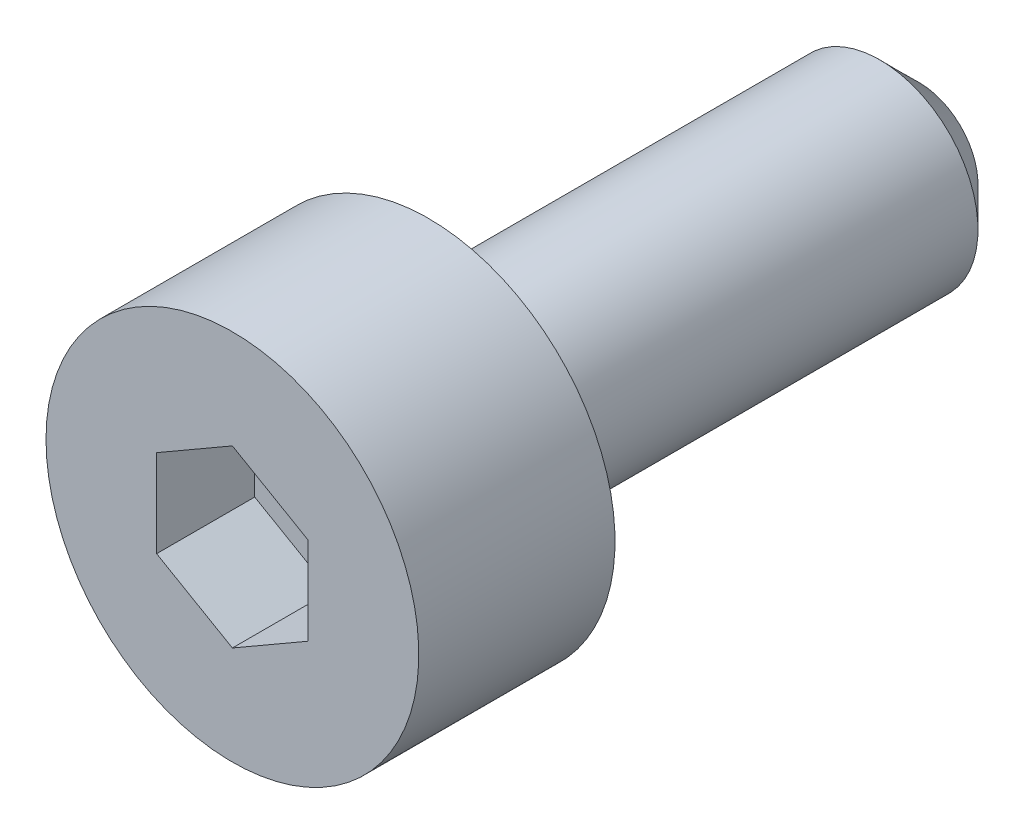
ISO-10303-21;
HEADER;
FILE_DESCRIPTION(('STEP AP214'),'2;1');
FILE_NAME('part.step','',(''),(''),'','','');
FILE_SCHEMA(('AUTOMOTIVE_DESIGN { 1 0 10303 214 1 1 1 1 }'));
ENDSEC;
DATA;
#1=APPLICATION_CONTEXT('core data for automotive mechanical design processes');
#2=APPLICATION_PROTOCOL_DEFINITION('international standard','automotive_design',2000,#1);
#3=PRODUCT_CONTEXT('',#1,'mechanical');
#4=PRODUCT('Part','Part','',(#3));
#5=PRODUCT_RELATED_PRODUCT_CATEGORY('part','',(#4));
#6=PRODUCT_DEFINITION_FORMATION('','',#4);
#7=PRODUCT_DEFINITION_CONTEXT('part definition',#1,'design');
#8=PRODUCT_DEFINITION('design','',#6,#7);
#9=PRODUCT_DEFINITION_SHAPE('','',#8);
#10=(LENGTH_UNIT() NAMED_UNIT(*) SI_UNIT(.MILLI.,.METRE.));
#11=(NAMED_UNIT(*) PLANE_ANGLE_UNIT() SI_UNIT($,.RADIAN.));
#12=(NAMED_UNIT(*) SI_UNIT($,.STERADIAN.) SOLID_ANGLE_UNIT());
#13=UNCERTAINTY_MEASURE_WITH_UNIT(LENGTH_MEASURE(1.E-05),#10,'distance_accuracy_value','');
#14=(GEOMETRIC_REPRESENTATION_CONTEXT(3) GLOBAL_UNCERTAINTY_ASSIGNED_CONTEXT((#13)) GLOBAL_UNIT_ASSIGNED_CONTEXT((#10,
#11,#12)) REPRESENTATION_CONTEXT('',''));
#15=CARTESIAN_POINT('',(0.,0.,0.));
#16=DIRECTION('',(0.,0.,1.));
#17=DIRECTION('',(1.,0.,0.));
#18=AXIS2_PLACEMENT_3D('',#15,#16,#17);
#19=CARTESIAN_POINT('',(0.,0.,0.));
#20=DIRECTION('',(0.,0.,-1.));
#21=DIRECTION('',(-1.,0.,0.));
#22=AXIS2_PLACEMENT_3D('',#19,#20,#21);
#23=PLANE('',#22);
#24=CARTESIAN_POINT('',(0.,0.,0.));
#25=DIRECTION('',(0.,0.,-1.));
#26=DIRECTION('',(-1.,0.,0.));
#27=AXIS2_PLACEMENT_3D('',#24,#25,#26);
#28=CIRCLE('',#27,1.9);
#29=CARTESIAN_POINT('',(-1.9,0.,0.));
#30=VERTEX_POINT('',#29);
#31=EDGE_CURVE('E124',#30,#30,#28,.T.);
#32=ORIENTED_EDGE('',*,*,#31,.T.);
#33=EDGE_LOOP('',(#32));
#34=FACE_BOUND('',#33,.T.);
#35=CARTESIAN_POINT('',(0.,0.,0.));
#36=DIRECTION('',(0.,0.,-1.));
#37=DIRECTION('',(-1.,0.,0.));
#38=AXIS2_PLACEMENT_3D('',#35,#36,#37);
#39=CIRCLE('',#38,1.);
#40=CARTESIAN_POINT('',(-1.,0.,0.));
#41=VERTEX_POINT('',#40);
#42=EDGE_CURVE('E116',#41,#41,#39,.T.);
#43=ORIENTED_EDGE('',*,*,#42,.F.);
#44=EDGE_LOOP('',(#43));
#45=FACE_BOUND('',#44,.T.);
#46=ADVANCED_FACE('F14',(#34,#45),#23,.T.);
#47=CARTESIAN_POINT('',(0.,0.,2.));
#48=DIRECTION('',(0.,0.,-1.));
#49=DIRECTION('',(-1.,0.,0.));
#50=AXIS2_PLACEMENT_3D('',#47,#48,#49);
#51=CYLINDRICAL_SURFACE('',#50,1.9);
#52=CARTESIAN_POINT('',(0.,0.,2.));
#53=DIRECTION('',(0.,0.,-1.));
#54=DIRECTION('',(-1.,0.,0.));
#55=AXIS2_PLACEMENT_3D('',#52,#53,#54);
#56=CIRCLE('',#55,1.9);
#57=CARTESIAN_POINT('',(-1.9,0.,2.));
#58=VERTEX_POINT('',#57);
#59=EDGE_CURVE('E125',#58,#58,#56,.T.);
#60=ORIENTED_EDGE('',*,*,#59,.T.);
#61=EDGE_LOOP('',(#60));
#62=FACE_BOUND('',#61,.T.);
#63=ORIENTED_EDGE('',*,*,#31,.F.);
#64=EDGE_LOOP('',(#63));
#65=FACE_BOUND('',#64,.T.);
#66=ADVANCED_FACE('F149',(#62,#65),#51,.T.);
#67=CARTESIAN_POINT('',(0.,0.,2.));
#68=DIRECTION('',(0.,0.,-1.));
#69=DIRECTION('',(-1.,0.,0.));
#70=AXIS2_PLACEMENT_3D('',#67,#68,#69);
#71=PLANE('',#70);
#72=DIRECTION('',(-0.866025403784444,-0.5,0.));
#73=VECTOR('',#72,1.);
#74=CARTESIAN_POINT('',(0.,0.892006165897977,2.));
#75=LINE('',#74,#73);
#76=CARTESIAN_POINT('',(0.,0.892006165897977,2.));
#77=VERTEX_POINT('',#76);
#78=CARTESIAN_POINT('',(-0.7725,0.446003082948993,2.));
#79=VERTEX_POINT('',#78);
#80=EDGE_CURVE('E103',#77,#79,#75,.T.);
#81=ORIENTED_EDGE('',*,*,#80,.F.);
#82=DIRECTION('',(-0.866025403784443,0.5,0.));
#83=VECTOR('',#82,1.);
#84=CARTESIAN_POINT('',(0.7725,0.446003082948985,2.));
#85=LINE('',#84,#83);
#86=CARTESIAN_POINT('',(0.7725,0.446003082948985,2.));
#87=VERTEX_POINT('',#86);
#88=EDGE_CURVE('E29',#87,#77,#85,.T.);
#89=ORIENTED_EDGE('',*,*,#88,.F.);
#90=DIRECTION('',(0.,1.,0.));
#91=VECTOR('',#90,1.);
#92=CARTESIAN_POINT('',(0.7725,-0.446003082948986,2.));
#93=LINE('',#92,#91);
#94=CARTESIAN_POINT('',(0.7725,-0.446003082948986,2.));
#95=VERTEX_POINT('',#94);
#96=EDGE_CURVE('E112',#95,#87,#93,.T.);
#97=ORIENTED_EDGE('',*,*,#96,.F.);
#98=DIRECTION('',(0.866025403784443,0.5,0.));
#99=VECTOR('',#98,1.);
#100=CARTESIAN_POINT('',(0.,-0.892006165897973,2.));
#101=LINE('',#100,#99);
#102=CARTESIAN_POINT('',(0.,-0.892006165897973,2.));
#103=VERTEX_POINT('',#102);
#104=EDGE_CURVE('E110',#103,#95,#101,.T.);
#105=ORIENTED_EDGE('',*,*,#104,.F.);
#106=DIRECTION('',(0.866025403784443,-0.5,0.));
#107=VECTOR('',#106,1.);
#108=CARTESIAN_POINT('',(-0.7725,-0.446003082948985,2.));
#109=LINE('',#108,#107);
#110=CARTESIAN_POINT('',(-0.7725,-0.446003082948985,2.));
#111=VERTEX_POINT('',#110);
#112=EDGE_CURVE('E77',#111,#103,#109,.T.);
#113=ORIENTED_EDGE('',*,*,#112,.F.);
#114=DIRECTION('',(0.,-1.,0.));
#115=VECTOR('',#114,1.);
#116=CARTESIAN_POINT('',(-0.7725,0.446003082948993,2.));
#117=LINE('',#116,#115);
#118=EDGE_CURVE('E106',#79,#111,#117,.T.);
#119=ORIENTED_EDGE('',*,*,#118,.F.);
#120=EDGE_LOOP('',(#81,#89,#97,#105,#113,#119));
#121=FACE_BOUND('',#120,.T.);
#122=ORIENTED_EDGE('',*,*,#59,.F.);
#123=EDGE_LOOP('',(#122));
#124=FACE_BOUND('',#123,.T.);
#125=ADVANCED_FACE('F156',(#121,#124),#71,.F.);
#126=CARTESIAN_POINT('',(0.,0.,-5.));
#127=DIRECTION('',(0.,0.,1.));
#128=DIRECTION('',(1.,0.,0.));
#129=AXIS2_PLACEMENT_3D('',#126,#127,#128);
#130=CYLINDRICAL_SURFACE('',#129,1.);
#131=CARTESIAN_POINT('',(0.,0.,-4.6));
#132=DIRECTION('',(0.,0.,-1.));
#133=DIRECTION('',(-1.,0.,0.));
#134=AXIS2_PLACEMENT_3D('',#131,#132,#133);
#135=CIRCLE('',#134,1.);
#136=CARTESIAN_POINT('',(-1.,0.,-4.6));
#137=VERTEX_POINT('',#136);
#138=EDGE_CURVE('E9',#137,#137,#135,.F.);
#139=ORIENTED_EDGE('',*,*,#138,.T.);
#140=EDGE_LOOP('',(#139));
#141=FACE_BOUND('',#140,.T.);
#142=ORIENTED_EDGE('',*,*,#42,.T.);
#143=EDGE_LOOP('',(#142));
#144=FACE_BOUND('',#143,.T.);
#145=ADVANCED_FACE('F145',(#141,#144),#130,.T.);
#146=CARTESIAN_POINT('',(0.,0.,-5.));
#147=DIRECTION('',(0.,0.,-1.));
#148=DIRECTION('',(-1.,0.,0.));
#149=AXIS2_PLACEMENT_3D('',#146,#147,#148);
#150=PLANE('',#149);
#151=CARTESIAN_POINT('',(0.,0.,-5.));
#152=DIRECTION('',(0.,0.,-1.));
#153=DIRECTION('',(-1.,0.,0.));
#154=AXIS2_PLACEMENT_3D('',#151,#152,#153);
#155=CIRCLE('',#154,0.6);
#156=CARTESIAN_POINT('',(-0.6,0.,-5.));
#157=VERTEX_POINT('',#156);
#158=EDGE_CURVE('E22',#157,#157,#155,.T.);
#159=ORIENTED_EDGE('',*,*,#158,.T.);
#160=EDGE_LOOP('',(#159));
#161=FACE_BOUND('',#160,.T.);
#162=ADVANCED_FACE('F132',(#161),#150,.T.);
#163=CARTESIAN_POINT('',(0.,0.,-5.));
#164=DIRECTION('',(0.,0.,1.));
#165=DIRECTION('',(1.,0.,0.));
#166=AXIS2_PLACEMENT_3D('',#163,#164,#165);
#167=CONICAL_SURFACE('',#166,0.6,0.785398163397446);
#168=ORIENTED_EDGE('',*,*,#138,.F.);
#169=EDGE_LOOP('',(#168));
#170=FACE_BOUND('',#169,.T.);
#171=ORIENTED_EDGE('',*,*,#158,.F.);
#172=EDGE_LOOP('',(#171));
#173=FACE_BOUND('',#172,.T.);
#174=ADVANCED_FACE('F16',(#170,#173),#167,.T.);
#175=CARTESIAN_POINT('',(0.7725,0.446003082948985,1.));
#176=DIRECTION('',(0.5,0.866025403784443,0.));
#177=DIRECTION('',(0.866025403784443,-0.5,0.));
#178=AXIS2_PLACEMENT_3D('',#175,#176,#177);
#179=PLANE('',#178);
#180=ORIENTED_EDGE('',*,*,#88,.T.);
#181=DIRECTION('',(0.,0.,1.));
#182=VECTOR('',#181,1.);
#183=CARTESIAN_POINT('',(0.,0.892006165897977,1.));
#184=LINE('',#183,#182);
#185=CARTESIAN_POINT('',(0.,0.892006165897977,1.));
#186=VERTEX_POINT('',#185);
#187=EDGE_CURVE('E59',#186,#77,#184,.T.);
#188=ORIENTED_EDGE('',*,*,#187,.F.);
#189=DIRECTION('',(-0.866025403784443,0.5,0.));
#190=VECTOR('',#189,1.);
#191=CARTESIAN_POINT('',(0.7725,0.446003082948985,1.));
#192=LINE('',#191,#190);
#193=CARTESIAN_POINT('',(0.7725,0.446003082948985,1.));
#194=VERTEX_POINT('',#193);
#195=EDGE_CURVE('E114',#194,#186,#192,.T.);
#196=ORIENTED_EDGE('',*,*,#195,.F.);
#197=DIRECTION('',(0.,0.,1.));
#198=VECTOR('',#197,1.);
#199=CARTESIAN_POINT('',(0.7725,0.446003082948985,1.));
#200=LINE('',#199,#198);
#201=EDGE_CURVE('E37',#194,#87,#200,.T.);
#202=ORIENTED_EDGE('',*,*,#201,.T.);
#203=EDGE_LOOP('',(#180,#188,#196,#202));
#204=FACE_BOUND('',#203,.T.);
#205=ADVANCED_FACE('F135',(#204),#179,.F.);
#206=CARTESIAN_POINT('',(0.7725,-0.446003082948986,1.));
#207=DIRECTION('',(1.,0.,0.));
#208=DIRECTION('',(0.,-1.,0.));
#209=AXIS2_PLACEMENT_3D('',#206,#207,#208);
#210=PLANE('',#209);
#211=ORIENTED_EDGE('',*,*,#96,.T.);
#212=ORIENTED_EDGE('',*,*,#201,.F.);
#213=DIRECTION('',(0.,1.,0.));
#214=VECTOR('',#213,1.);
#215=CARTESIAN_POINT('',(0.7725,-0.446003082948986,1.));
#216=LINE('',#215,#214);
#217=CARTESIAN_POINT('',(0.7725,-0.446003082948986,1.));
#218=VERTEX_POINT('',#217);
#219=EDGE_CURVE('E89',#218,#194,#216,.T.);
#220=ORIENTED_EDGE('',*,*,#219,.F.);
#221=DIRECTION('',(0.,0.,1.));
#222=VECTOR('',#221,1.);
#223=CARTESIAN_POINT('',(0.7725,-0.446003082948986,1.));
#224=LINE('',#223,#222);
#225=EDGE_CURVE('E81',#218,#95,#224,.T.);
#226=ORIENTED_EDGE('',*,*,#225,.T.);
#227=EDGE_LOOP('',(#211,#212,#220,#226));
#228=FACE_BOUND('',#227,.T.);
#229=ADVANCED_FACE('F143',(#228),#210,.F.);
#230=CARTESIAN_POINT('',(0.,-0.892006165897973,1.));
#231=DIRECTION('',(0.5,-0.866025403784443,0.));
#232=DIRECTION('',(-0.866025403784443,-0.5,0.));
#233=AXIS2_PLACEMENT_3D('',#230,#231,#232);
#234=PLANE('',#233);
#235=ORIENTED_EDGE('',*,*,#104,.T.);
#236=ORIENTED_EDGE('',*,*,#225,.F.);
#237=DIRECTION('',(0.866025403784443,0.5,0.));
#238=VECTOR('',#237,1.);
#239=CARTESIAN_POINT('',(0.,-0.892006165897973,1.));
#240=LINE('',#239,#238);
#241=CARTESIAN_POINT('',(0.,-0.892006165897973,1.));
#242=VERTEX_POINT('',#241);
#243=EDGE_CURVE('E85',#242,#218,#240,.T.);
#244=ORIENTED_EDGE('',*,*,#243,.F.);
#245=DIRECTION('',(0.,0.,1.));
#246=VECTOR('',#245,1.);
#247=CARTESIAN_POINT('',(0.,-0.892006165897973,1.));
#248=LINE('',#247,#246);
#249=EDGE_CURVE('E70',#242,#103,#248,.T.);
#250=ORIENTED_EDGE('',*,*,#249,.T.);
#251=EDGE_LOOP('',(#235,#236,#244,#250));
#252=FACE_BOUND('',#251,.T.);
#253=ADVANCED_FACE('F86',(#252),#234,.F.);
#254=CARTESIAN_POINT('',(-0.7725,-0.446003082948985,1.));
#255=DIRECTION('',(-0.5,-0.866025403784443,0.));
#256=DIRECTION('',(-0.866025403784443,0.5,0.));
#257=AXIS2_PLACEMENT_3D('',#254,#255,#256);
#258=PLANE('',#257);
#259=ORIENTED_EDGE('',*,*,#112,.T.);
#260=ORIENTED_EDGE('',*,*,#249,.F.);
#261=DIRECTION('',(0.866025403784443,-0.5,0.));
#262=VECTOR('',#261,1.);
#263=CARTESIAN_POINT('',(-0.7725,-0.446003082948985,1.));
#264=LINE('',#263,#262);
#265=CARTESIAN_POINT('',(-0.7725,-0.446003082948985,1.));
#266=VERTEX_POINT('',#265);
#267=EDGE_CURVE('E74',#266,#242,#264,.T.);
#268=ORIENTED_EDGE('',*,*,#267,.F.);
#269=DIRECTION('',(0.,0.,1.));
#270=VECTOR('',#269,1.);
#271=CARTESIAN_POINT('',(-0.7725,-0.446003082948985,1.));
#272=LINE('',#271,#270);
#273=EDGE_CURVE('E82',#266,#111,#272,.T.);
#274=ORIENTED_EDGE('',*,*,#273,.T.);
#275=EDGE_LOOP('',(#259,#260,#268,#274));
#276=FACE_BOUND('',#275,.T.);
#277=ADVANCED_FACE('F72',(#276),#258,.F.);
#278=CARTESIAN_POINT('',(-0.7725,0.446003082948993,1.));
#279=DIRECTION('',(-1.,0.,0.));
#280=DIRECTION('',(0.,1.,0.));
#281=AXIS2_PLACEMENT_3D('',#278,#279,#280);
#282=PLANE('',#281);
#283=ORIENTED_EDGE('',*,*,#118,.T.);
#284=ORIENTED_EDGE('',*,*,#273,.F.);
#285=DIRECTION('',(0.,-1.,0.));
#286=VECTOR('',#285,1.);
#287=CARTESIAN_POINT('',(-0.7725,0.446003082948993,1.));
#288=LINE('',#287,#286);
#289=CARTESIAN_POINT('',(-0.7725,0.446003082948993,1.));
#290=VERTEX_POINT('',#289);
#291=EDGE_CURVE('E95',#290,#266,#288,.T.);
#292=ORIENTED_EDGE('',*,*,#291,.F.);
#293=DIRECTION('',(0.,0.,1.));
#294=VECTOR('',#293,1.);
#295=CARTESIAN_POINT('',(-0.7725,0.446003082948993,1.));
#296=LINE('',#295,#294);
#297=EDGE_CURVE('E119',#290,#79,#296,.T.);
#298=ORIENTED_EDGE('',*,*,#297,.T.);
#299=EDGE_LOOP('',(#283,#284,#292,#298));
#300=FACE_BOUND('',#299,.T.);
#301=ADVANCED_FACE('F169',(#300),#282,.F.);
#302=CARTESIAN_POINT('',(0.,0.892006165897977,1.));
#303=DIRECTION('',(-0.5,0.866025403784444,0.));
#304=DIRECTION('',(0.866025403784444,0.5,0.));
#305=AXIS2_PLACEMENT_3D('',#302,#303,#304);
#306=PLANE('',#305);
#307=ORIENTED_EDGE('',*,*,#80,.T.);
#308=ORIENTED_EDGE('',*,*,#297,.F.);
#309=DIRECTION('',(-0.866025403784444,-0.5,0.));
#310=VECTOR('',#309,1.);
#311=CARTESIAN_POINT('',(0.,0.892006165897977,1.));
#312=LINE('',#311,#310);
#313=EDGE_CURVE('E97',#186,#290,#312,.T.);
#314=ORIENTED_EDGE('',*,*,#313,.F.);
#315=ORIENTED_EDGE('',*,*,#187,.T.);
#316=EDGE_LOOP('',(#307,#308,#314,#315));
#317=FACE_BOUND('',#316,.T.);
#318=ADVANCED_FACE('F166',(#317),#306,.F.);
#319=CARTESIAN_POINT('',(0.,0.892006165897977,1.));
#320=DIRECTION('',(0.,0.,1.));
#321=DIRECTION('',(1.,0.,0.));
#322=AXIS2_PLACEMENT_3D('',#319,#320,#321);
#323=PLANE('',#322);
#324=ORIENTED_EDGE('',*,*,#195,.T.);
#325=ORIENTED_EDGE('',*,*,#313,.T.);
#326=ORIENTED_EDGE('',*,*,#291,.T.);
#327=ORIENTED_EDGE('',*,*,#267,.T.);
#328=ORIENTED_EDGE('',*,*,#243,.T.);
#329=ORIENTED_EDGE('',*,*,#219,.T.);
#330=EDGE_LOOP('',(#324,#325,#326,#327,#328,#329));
#331=FACE_BOUND('',#330,.T.);
#332=ADVANCED_FACE('F92',(#331),#323,.T.);
#333=CLOSED_SHELL('',(#46,#66,#125,#145,#162,#174,#205,#229,#253,#277,#301,#318,#332));
#334=MANIFOLD_SOLID_BREP('B1',#333);
#335=ADVANCED_BREP_SHAPE_REPRESENTATION('',(#18,#334),#14);
#336=SHAPE_DEFINITION_REPRESENTATION(#9,#335);
ENDSEC;
END-ISO-10303-21;
